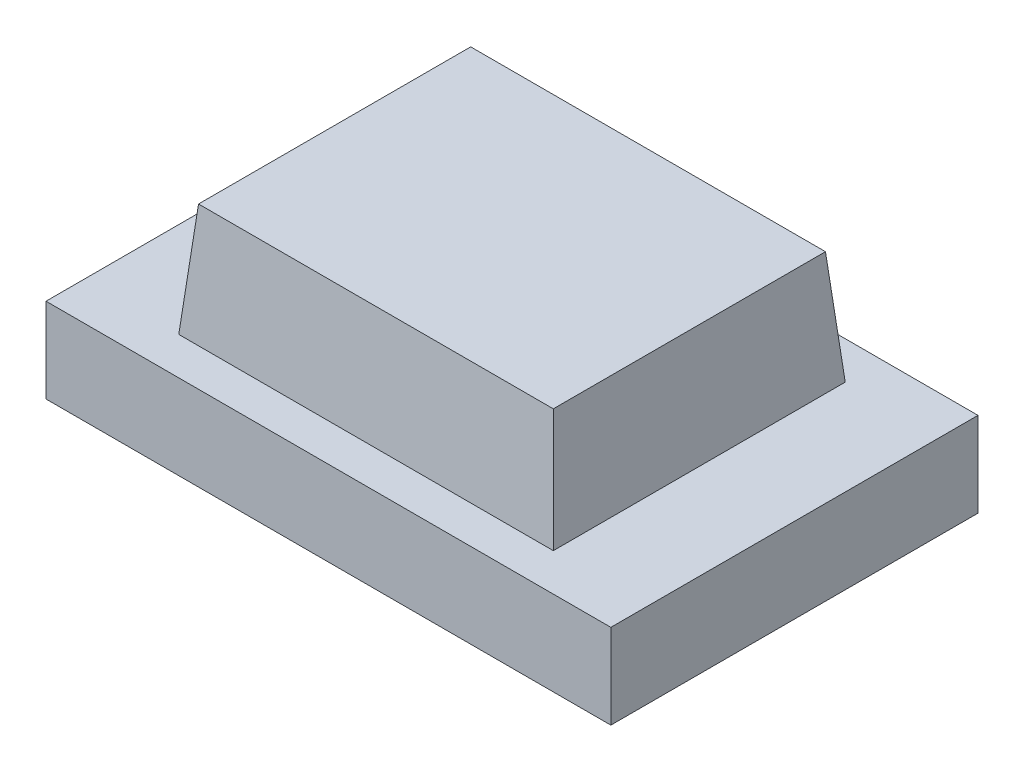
ISO-10303-21;
HEADER;
FILE_DESCRIPTION(('STEP AP214'),'2;1');
FILE_NAME('part.step','',(''),(''),'','','');
FILE_SCHEMA(('AUTOMOTIVE_DESIGN { 1 0 10303 214 1 1 1 1 }'));
ENDSEC;
DATA;
#1=APPLICATION_CONTEXT('core data for automotive mechanical design processes');
#2=APPLICATION_PROTOCOL_DEFINITION('international standard','automotive_design',2000,#1);
#3=PRODUCT_CONTEXT('',#1,'mechanical');
#4=PRODUCT('Part','Part','',(#3));
#5=PRODUCT_RELATED_PRODUCT_CATEGORY('part','',(#4));
#6=PRODUCT_DEFINITION_FORMATION('','',#4);
#7=PRODUCT_DEFINITION_CONTEXT('part definition',#1,'design');
#8=PRODUCT_DEFINITION('design','',#6,#7);
#9=PRODUCT_DEFINITION_SHAPE('','',#8);
#10=(LENGTH_UNIT() NAMED_UNIT(*) SI_UNIT(.MILLI.,.METRE.));
#11=(NAMED_UNIT(*) PLANE_ANGLE_UNIT() SI_UNIT($,.RADIAN.));
#12=(NAMED_UNIT(*) SI_UNIT($,.STERADIAN.) SOLID_ANGLE_UNIT());
#13=UNCERTAINTY_MEASURE_WITH_UNIT(LENGTH_MEASURE(1.E-05),#10,'distance_accuracy_value','');
#14=(GEOMETRIC_REPRESENTATION_CONTEXT(3) GLOBAL_UNCERTAINTY_ASSIGNED_CONTEXT((#13)) GLOBAL_UNIT_ASSIGNED_CONTEXT((#10,
#11,#12)) REPRESENTATION_CONTEXT('',''));
#15=CARTESIAN_POINT('',(0.,0.,0.));
#16=DIRECTION('',(0.,0.,1.));
#17=DIRECTION('',(1.,0.,0.));
#18=AXIS2_PLACEMENT_3D('',#15,#16,#17);
#19=CARTESIAN_POINT('',(0.,0.7,0.));
#20=DIRECTION('',(0.,1.,0.));
#21=DIRECTION('',(0.,0.,1.));
#22=AXIS2_PLACEMENT_3D('',#19,#20,#21);
#23=PLANE('',#22);
#24=DIRECTION('',(1.,0.,0.));
#25=VECTOR('',#24,1.);
#26=CARTESIAN_POINT('',(0.,0.7,-7.73306624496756));
#27=LINE('',#26,#25);
#28=CARTESIAN_POINT('',(-8.90698254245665,0.7,-7.73306624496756));
#29=VERTEX_POINT('',#28);
#30=CARTESIAN_POINT('',(-10.1632084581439,0.7,-7.73306624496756));
#31=VERTEX_POINT('',#30);
#32=EDGE_CURVE('E100',#29,#31,#27,.F.);
#33=ORIENTED_EDGE('',*,*,#32,.F.);
#34=DIRECTION('',(0.,0.,1.));
#35=VECTOR('',#34,1.);
#36=CARTESIAN_POINT('',(-8.90698254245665,0.7,0.));
#37=LINE('',#36,#35);
#38=CARTESIAN_POINT('',(-8.90698254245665,0.7,-8.69672862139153));
#39=VERTEX_POINT('',#38);
#40=EDGE_CURVE('E86',#39,#29,#37,.T.);
#41=ORIENTED_EDGE('',*,*,#40,.F.);
#42=DIRECTION('',(1.,0.,0.));
#43=VECTOR('',#42,1.);
#44=CARTESIAN_POINT('',(0.,0.7,-8.69672862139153));
#45=LINE('',#44,#43);
#46=CARTESIAN_POINT('',(-10.1632084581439,0.7,-8.69672862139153));
#47=VERTEX_POINT('',#46);
#48=EDGE_CURVE('E21',#47,#39,#45,.T.);
#49=ORIENTED_EDGE('',*,*,#48,.F.);
#50=DIRECTION('',(0.,0.,1.));
#51=VECTOR('',#50,1.);
#52=CARTESIAN_POINT('',(-10.1632084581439,0.7,0.));
#53=LINE('',#52,#51);
#54=EDGE_CURVE('E81',#31,#47,#53,.F.);
#55=ORIENTED_EDGE('',*,*,#54,.F.);
#56=EDGE_LOOP('',(#33,#41,#49,#55));
#57=FACE_BOUND('',#56,.T.);
#58=ADVANCED_FACE('F18',(#57),#23,.T.);
#59=CARTESIAN_POINT('',(0.,0.7,-8.69672862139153));
#60=DIRECTION('',(0.,0.0871557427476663,-0.996194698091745));
#61=DIRECTION('',(0.,0.996194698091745,0.0871557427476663));
#62=AXIS2_PLACEMENT_3D('',#59,#60,#61);
#63=PLANE('',#62);
#64=DIRECTION('',(-0.0868265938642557,-0.992432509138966,-0.0868265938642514));
#65=VECTOR('',#64,1.);
#66=CARTESIAN_POINT('',(-10.1632084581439,0.7,-8.69672862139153));
#67=LINE('',#66,#65);
#68=CARTESIAN_POINT('',(-10.1982039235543,0.3,-8.7317240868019));
#69=VERTEX_POINT('',#68);
#70=EDGE_CURVE('E89',#47,#69,#67,.T.);
#71=ORIENTED_EDGE('',*,*,#70,.F.);
#72=ORIENTED_EDGE('',*,*,#48,.T.);
#73=DIRECTION('',(-0.0868265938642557,0.992432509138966,0.0868265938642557));
#74=VECTOR('',#73,1.);
#75=CARTESIAN_POINT('',(-8.87198707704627,0.3,-8.73172408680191));
#76=LINE('',#75,#74);
#77=CARTESIAN_POINT('',(-8.87198707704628,0.3,-8.7317240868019));
#78=VERTEX_POINT('',#77);
#79=EDGE_CURVE('E108',#78,#39,#76,.T.);
#80=ORIENTED_EDGE('',*,*,#79,.F.);
#81=DIRECTION('',(1.,0.,0.));
#82=VECTOR('',#81,1.);
#83=CARTESIAN_POINT('',(0.,0.3,-8.7317240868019));
#84=LINE('',#83,#82);
#85=EDGE_CURVE('E93',#78,#69,#84,.F.);
#86=ORIENTED_EDGE('',*,*,#85,.T.);
#87=EDGE_LOOP('',(#71,#72,#80,#86));
#88=FACE_BOUND('',#87,.T.);
#89=ADVANCED_FACE('F91',(#88),#63,.T.);
#90=CARTESIAN_POINT('',(-10.1632084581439,0.7,0.));
#91=DIRECTION('',(-0.996194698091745,0.0871557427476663,0.));
#92=DIRECTION('',(-0.0871557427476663,-0.996194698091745,0.));
#93=AXIS2_PLACEMENT_3D('',#90,#91,#92);
#94=PLANE('',#93);
#95=DIRECTION('',(-0.0868265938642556,-0.992432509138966,0.0868265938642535));
#96=VECTOR('',#95,1.);
#97=CARTESIAN_POINT('',(-10.1632084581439,0.7,-7.73306624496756));
#98=LINE('',#97,#96);
#99=CARTESIAN_POINT('',(-10.1982039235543,0.3,-7.69807077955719));
#100=VERTEX_POINT('',#99);
#101=EDGE_CURVE('E98',#31,#100,#98,.T.);
#102=ORIENTED_EDGE('',*,*,#101,.F.);
#103=ORIENTED_EDGE('',*,*,#54,.T.);
#104=ORIENTED_EDGE('',*,*,#70,.T.);
#105=DIRECTION('',(0.,0.,-1.));
#106=VECTOR('',#105,1.);
#107=CARTESIAN_POINT('',(-10.1982039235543,0.3,0.));
#108=LINE('',#107,#106);
#109=EDGE_CURVE('E112',#69,#100,#108,.F.);
#110=ORIENTED_EDGE('',*,*,#109,.T.);
#111=EDGE_LOOP('',(#102,#103,#104,#110));
#112=FACE_BOUND('',#111,.T.);
#113=ADVANCED_FACE('F96',(#112),#94,.T.);
#114=CARTESIAN_POINT('',(0.,0.7,-7.73306624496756));
#115=DIRECTION('',(0.,0.0871557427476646,0.996194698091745));
#116=DIRECTION('',(0.,-0.996194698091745,0.0871557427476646));
#117=AXIS2_PLACEMENT_3D('',#114,#115,#116);
#118=PLANE('',#117);
#119=ORIENTED_EDGE('',*,*,#101,.T.);
#120=DIRECTION('',(1.,0.,0.));
#121=VECTOR('',#120,1.);
#122=CARTESIAN_POINT('',(0.,0.3,-7.69807077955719));
#123=LINE('',#122,#121);
#124=CARTESIAN_POINT('',(-8.87198707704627,0.3,-7.69807077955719));
#125=VERTEX_POINT('',#124);
#126=EDGE_CURVE('E114',#100,#125,#123,.T.);
#127=ORIENTED_EDGE('',*,*,#126,.T.);
#128=DIRECTION('',(0.0868265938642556,-0.992432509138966,0.0868265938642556));
#129=VECTOR('',#128,1.);
#130=CARTESIAN_POINT('',(-8.90698254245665,0.7,-7.73306624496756));
#131=LINE('',#130,#129);
#132=EDGE_CURVE('E105',#29,#125,#131,.T.);
#133=ORIENTED_EDGE('',*,*,#132,.F.);
#134=ORIENTED_EDGE('',*,*,#32,.T.);
#135=EDGE_LOOP('',(#119,#127,#133,#134));
#136=FACE_BOUND('',#135,.T.);
#137=ADVANCED_FACE('F180',(#136),#118,.T.);
#138=CARTESIAN_POINT('',(-8.90698254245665,0.7,0.));
#139=DIRECTION('',(0.996194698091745,0.0871557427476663,0.));
#140=DIRECTION('',(-0.0871557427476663,0.996194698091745,0.));
#141=AXIS2_PLACEMENT_3D('',#138,#139,#140);
#142=PLANE('',#141);
#143=ORIENTED_EDGE('',*,*,#79,.T.);
#144=ORIENTED_EDGE('',*,*,#40,.T.);
#145=ORIENTED_EDGE('',*,*,#132,.T.);
#146=DIRECTION('',(0.,0.,-1.));
#147=VECTOR('',#146,1.);
#148=CARTESIAN_POINT('',(-8.87198707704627,0.3,0.));
#149=LINE('',#148,#147);
#150=EDGE_CURVE('E116',#125,#78,#149,.T.);
#151=ORIENTED_EDGE('',*,*,#150,.T.);
#152=EDGE_LOOP('',(#143,#144,#145,#151));
#153=FACE_BOUND('',#152,.T.);
#154=ADVANCED_FACE('F177',(#153),#142,.T.);
#155=CARTESIAN_POINT('',(0.,0.3,0.));
#156=DIRECTION('',(0.,-1.,0.));
#157=DIRECTION('',(0.,0.,-1.));
#158=AXIS2_PLACEMENT_3D('',#155,#156,#157);
#159=PLANE('',#158);
#160=DIRECTION('',(-1.,0.,0.));
#161=VECTOR('',#160,1.);
#162=CARTESIAN_POINT('',(-8.5350955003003,0.3,-7.56489743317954));
#163=LINE('',#162,#161);
#164=CARTESIAN_POINT('',(-10.5350955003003,0.3,-7.56489743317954));
#165=VERTEX_POINT('',#164);
#166=CARTESIAN_POINT('',(-8.5350955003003,0.3,-7.56489743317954));
#167=VERTEX_POINT('',#166);
#168=EDGE_CURVE('E132',#165,#167,#163,.F.);
#169=ORIENTED_EDGE('',*,*,#168,.T.);
#170=DIRECTION('',(0.,0.,1.));
#171=VECTOR('',#170,1.);
#172=CARTESIAN_POINT('',(-8.5350955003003,0.3,-8.86489743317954));
#173=LINE('',#172,#171);
#174=CARTESIAN_POINT('',(-8.5350955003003,0.3,-8.86489743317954));
#175=VERTEX_POINT('',#174);
#176=EDGE_CURVE('E125',#167,#175,#173,.F.);
#177=ORIENTED_EDGE('',*,*,#176,.T.);
#178=DIRECTION('',(1.,0.,0.));
#179=VECTOR('',#178,1.);
#180=CARTESIAN_POINT('',(-10.5350955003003,0.3,-8.86489743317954));
#181=LINE('',#180,#179);
#182=CARTESIAN_POINT('',(-10.5350955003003,0.3,-8.86489743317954));
#183=VERTEX_POINT('',#182);
#184=EDGE_CURVE('E121',#175,#183,#181,.F.);
#185=ORIENTED_EDGE('',*,*,#184,.T.);
#186=DIRECTION('',(0.,0.,-1.));
#187=VECTOR('',#186,1.);
#188=CARTESIAN_POINT('',(-10.5350955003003,0.3,-7.56489743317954));
#189=LINE('',#188,#187);
#190=EDGE_CURVE('E119',#183,#165,#189,.F.);
#191=ORIENTED_EDGE('',*,*,#190,.T.);
#192=EDGE_LOOP('',(#169,#177,#185,#191));
#193=FACE_BOUND('',#192,.T.);
#194=ORIENTED_EDGE('',*,*,#126,.F.);
#195=ORIENTED_EDGE('',*,*,#109,.F.);
#196=ORIENTED_EDGE('',*,*,#85,.F.);
#197=ORIENTED_EDGE('',*,*,#150,.F.);
#198=EDGE_LOOP('',(#194,#195,#196,#197));
#199=FACE_BOUND('',#198,.T.);
#200=ADVANCED_FACE('F153',(#193,#199),#159,.F.);
#201=CARTESIAN_POINT('',(-10.5350955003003,0.3,-7.56489743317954));
#202=DIRECTION('',(1.,0.,0.));
#203=DIRECTION('',(0.,0.,-1.));
#204=AXIS2_PLACEMENT_3D('',#201,#202,#203);
#205=PLANE('',#204);
#206=DIRECTION('',(0.,1.,0.));
#207=VECTOR('',#206,1.);
#208=CARTESIAN_POINT('',(-10.5350955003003,0.3,-7.56489743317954));
#209=LINE('',#208,#207);
#210=CARTESIAN_POINT('',(-10.5350955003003,0.,-7.56489743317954));
#211=VERTEX_POINT('',#210);
#212=EDGE_CURVE('E129',#211,#165,#209,.T.);
#213=ORIENTED_EDGE('',*,*,#212,.T.);
#214=ORIENTED_EDGE('',*,*,#190,.F.);
#215=DIRECTION('',(0.,1.,0.));
#216=VECTOR('',#215,1.);
#217=CARTESIAN_POINT('',(-10.5350955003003,0.3,-8.86489743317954));
#218=LINE('',#217,#216);
#219=CARTESIAN_POINT('',(-10.5350955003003,0.,-8.86489743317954));
#220=VERTEX_POINT('',#219);
#221=EDGE_CURVE('E123',#183,#220,#218,.F.);
#222=ORIENTED_EDGE('',*,*,#221,.T.);
#223=DIRECTION('',(0.,0.,-1.));
#224=VECTOR('',#223,1.);
#225=CARTESIAN_POINT('',(-10.5350955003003,0.,0.));
#226=LINE('',#225,#224);
#227=EDGE_CURVE('E135',#211,#220,#226,.T.);
#228=ORIENTED_EDGE('',*,*,#227,.F.);
#229=EDGE_LOOP('',(#213,#214,#222,#228));
#230=FACE_BOUND('',#229,.T.);
#231=ADVANCED_FACE('F156',(#230),#205,.F.);
#232=CARTESIAN_POINT('',(-10.5350955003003,0.3,-8.86489743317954));
#233=DIRECTION('',(0.,0.,1.));
#234=DIRECTION('',(1.,0.,0.));
#235=AXIS2_PLACEMENT_3D('',#232,#233,#234);
#236=PLANE('',#235);
#237=ORIENTED_EDGE('',*,*,#221,.F.);
#238=ORIENTED_EDGE('',*,*,#184,.F.);
#239=DIRECTION('',(0.,1.,0.));
#240=VECTOR('',#239,1.);
#241=CARTESIAN_POINT('',(-8.5350955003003,0.3,-8.86489743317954));
#242=LINE('',#241,#240);
#243=CARTESIAN_POINT('',(-8.5350955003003,0.,-8.86489743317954));
#244=VERTEX_POINT('',#243);
#245=EDGE_CURVE('E127',#175,#244,#242,.F.);
#246=ORIENTED_EDGE('',*,*,#245,.T.);
#247=DIRECTION('',(1.,0.,0.));
#248=VECTOR('',#247,1.);
#249=CARTESIAN_POINT('',(0.,0.,-8.86489743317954));
#250=LINE('',#249,#248);
#251=EDGE_CURVE('E138',#220,#244,#250,.T.);
#252=ORIENTED_EDGE('',*,*,#251,.F.);
#253=EDGE_LOOP('',(#237,#238,#246,#252));
#254=FACE_BOUND('',#253,.T.);
#255=ADVANCED_FACE('F150',(#254),#236,.F.);
#256=CARTESIAN_POINT('',(-8.5350955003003,0.3,-8.86489743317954));
#257=DIRECTION('',(-1.,0.,0.));
#258=DIRECTION('',(0.,0.,1.));
#259=AXIS2_PLACEMENT_3D('',#256,#257,#258);
#260=PLANE('',#259);
#261=ORIENTED_EDGE('',*,*,#245,.F.);
#262=ORIENTED_EDGE('',*,*,#176,.F.);
#263=DIRECTION('',(0.,1.,0.));
#264=VECTOR('',#263,1.);
#265=CARTESIAN_POINT('',(-8.5350955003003,0.3,-7.56489743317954));
#266=LINE('',#265,#264);
#267=CARTESIAN_POINT('',(-8.5350955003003,0.,-7.56489743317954));
#268=VERTEX_POINT('',#267);
#269=EDGE_CURVE('E36',#167,#268,#266,.F.);
#270=ORIENTED_EDGE('',*,*,#269,.T.);
#271=DIRECTION('',(0.,0.,-1.));
#272=VECTOR('',#271,1.);
#273=CARTESIAN_POINT('',(-8.5350955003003,0.,0.));
#274=LINE('',#273,#272);
#275=EDGE_CURVE('E27',#244,#268,#274,.F.);
#276=ORIENTED_EDGE('',*,*,#275,.F.);
#277=EDGE_LOOP('',(#261,#262,#270,#276));
#278=FACE_BOUND('',#277,.T.);
#279=ADVANCED_FACE('F146',(#278),#260,.F.);
#280=CARTESIAN_POINT('',(-8.5350955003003,0.3,-7.56489743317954));
#281=DIRECTION('',(0.,0.,-1.));
#282=DIRECTION('',(-1.,0.,0.));
#283=AXIS2_PLACEMENT_3D('',#280,#281,#282);
#284=PLANE('',#283);
#285=ORIENTED_EDGE('',*,*,#269,.F.);
#286=ORIENTED_EDGE('',*,*,#168,.F.);
#287=ORIENTED_EDGE('',*,*,#212,.F.);
#288=DIRECTION('',(1.,0.,0.));
#289=VECTOR('',#288,1.);
#290=CARTESIAN_POINT('',(0.,0.,-7.56489743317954));
#291=LINE('',#290,#289);
#292=EDGE_CURVE('E11',#268,#211,#291,.F.);
#293=ORIENTED_EDGE('',*,*,#292,.F.);
#294=EDGE_LOOP('',(#285,#286,#287,#293));
#295=FACE_BOUND('',#294,.T.);
#296=ADVANCED_FACE('F160',(#295),#284,.F.);
#297=CARTESIAN_POINT('',(0.,0.,0.));
#298=DIRECTION('',(0.,-1.,0.));
#299=DIRECTION('',(0.,0.,-1.));
#300=AXIS2_PLACEMENT_3D('',#297,#298,#299);
#301=PLANE('',#300);
#302=ORIENTED_EDGE('',*,*,#275,.T.);
#303=ORIENTED_EDGE('',*,*,#292,.T.);
#304=ORIENTED_EDGE('',*,*,#227,.T.);
#305=ORIENTED_EDGE('',*,*,#251,.T.);
#306=EDGE_LOOP('',(#302,#303,#304,#305));
#307=FACE_BOUND('',#306,.T.);
#308=ADVANCED_FACE('F143',(#307),#301,.T.);
#309=CLOSED_SHELL('',(#58,#89,#113,#137,#154,#200,#231,#255,#279,#296,#308));
#310=MANIFOLD_SOLID_BREP('B1',#309);
#311=ADVANCED_BREP_SHAPE_REPRESENTATION('',(#18,#310),#14);
#312=SHAPE_DEFINITION_REPRESENTATION(#9,#311);
ENDSEC;
END-ISO-10303-21;
